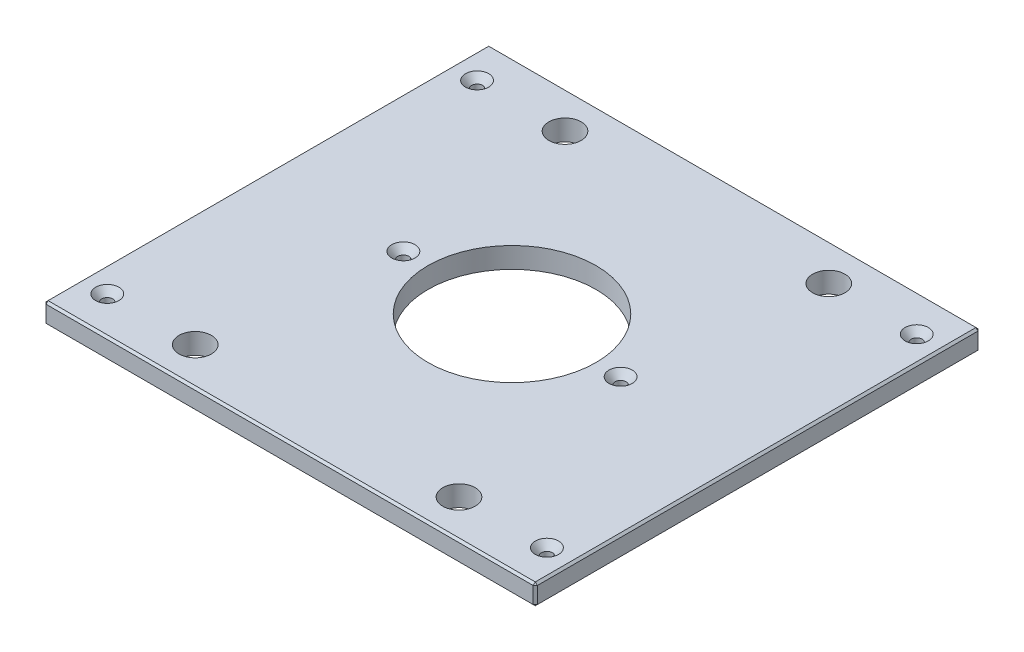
from build123d import *

# Parameters (mm, degrees)
SKETCH1_W                                        = 301.625
SKETCH1_H                                        = 273.05
BOSS_EXTRUDE1_DEPTH                              = 12.7
SKETCH13_R                                       = 51.562
CUT_EXTRUDE6_DEPTH                               = 204.82535608
F_25_32_0_78125_DIAMETER_HOLE1_D                 = 19.84375
CHAMFER2_SIZE                                    = 1.27
CSK_FOR_1_4_FLAT_HEAD_MACHINE_SCREW1_D           = 6.7564
CSK_FOR_1_4_FLAT_HEAD_MACHINE_SCREW1_CSINK_D     = 14.2748
CSK_FOR_1_4_FLAT_HEAD_MACHINE_SCREW1_CSINK_ANGLE = 82


with BuildPart() as part:
    # Sketch1 → Boss-Extrude1 (new body)
    with BuildSketch(Plane(origin=(0, 0, 0), x_dir=(1, 0, 0), z_dir=(0, 1, 0))):
        Rectangle(SKETCH1_W, SKETCH1_H)
    extrude(amount=BOSS_EXTRUDE1_DEPTH)

    # Sketch13 → Cut-Extrude6 (cut, through all)
    with BuildSketch(Plane(origin=(0, 12.7, 0), x_dir=(1, 0, 0), z_dir=(0, 1, 0))):
        with Locations(Location((0, 0, 0), (0, 0, 270))):
            Circle(SKETCH13_R)
    extrude(amount=-CUT_EXTRUDE6_DEPTH, mode=Mode.SUBTRACT)

    # 25_32 _0.78125_ Diameter Hole1 (through all)
    with Locations(Plane(origin=(0, 12.7, 0), x_dir=(1, 0, 0), z_dir=(0, 1, 0))):
        with Locations((80.9625, 113.50498), (-80.9625, 113.50498), (80.9625, -113.50498), (-80.9625, -113.50498)):
            Hole(F_25_32_0_78125_DIAMETER_HOLE1_D / 2)

    # Chamfer2
    chamfer2_edges = [part.edges().sort_by_distance(p)[0] for p in [
        (150.8125, 12.7, 0),
        (0, 12.7, -136.525),
        (-150.8125, 12.7, 0),
        (0, 0, -136.525),
        (150.8125, 0, 0),
        (0, 0, 136.525),
        (-150.8125, 0, 0),
        (0, 12.7, 136.525),
        (-150.8125, 6.35, -136.525),
        (150.8125, 6.35, -136.525),
        (150.8125, 6.35, 136.525),
        (-150.8125, 6.35, 136.525),
    ]]
    chamfer(chamfer2_edges, length=CHAMFER2_SIZE)

    # CSK for 1_4 Flat Head Machine Screw1 (through all)
    with Locations(Plane(origin=(0, 12.7, 0), x_dir=(1, 0, 0), z_dir=(0, 1, 0))):
        with Locations((134.9375, 113.50498), (134.9375, -113.50498), (-134.9375, -113.50498), (-66.675, 0), (66.675, 0), (-134.9375, 113.50498), (-80.9625, 113.50498), (-80.9625, -113.50498)):
            CounterSinkHole(CSK_FOR_1_4_FLAT_HEAD_MACHINE_SCREW1_D / 2, CSK_FOR_1_4_FLAT_HEAD_MACHINE_SCREW1_CSINK_D / 2, counter_sink_angle=CSK_FOR_1_4_FLAT_HEAD_MACHINE_SCREW1_CSINK_ANGLE)


solid = part.part
